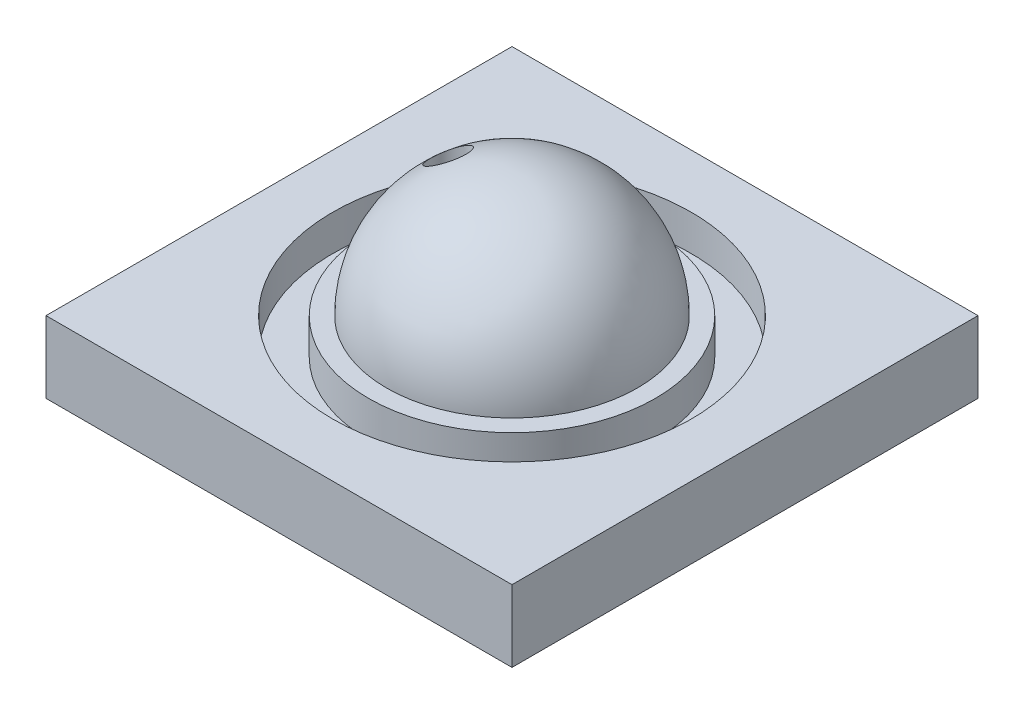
ISO-10303-21;
HEADER;
FILE_DESCRIPTION(('STEP AP214'),'2;1');
FILE_NAME('part.step','',(''),(''),'','','');
FILE_SCHEMA(('AUTOMOTIVE_DESIGN { 1 0 10303 214 1 1 1 1 }'));
ENDSEC;
DATA;
#1=APPLICATION_CONTEXT('core data for automotive mechanical design processes');
#2=APPLICATION_PROTOCOL_DEFINITION('international standard','automotive_design',2000,#1);
#3=PRODUCT_CONTEXT('',#1,'mechanical');
#4=PRODUCT('Part','Part','',(#3));
#5=PRODUCT_RELATED_PRODUCT_CATEGORY('part','',(#4));
#6=PRODUCT_DEFINITION_FORMATION('','',#4);
#7=PRODUCT_DEFINITION_CONTEXT('part definition',#1,'design');
#8=PRODUCT_DEFINITION('design','',#6,#7);
#9=PRODUCT_DEFINITION_SHAPE('','',#8);
#10=(LENGTH_UNIT() NAMED_UNIT(*) SI_UNIT(.MILLI.,.METRE.));
#11=(NAMED_UNIT(*) PLANE_ANGLE_UNIT() SI_UNIT($,.RADIAN.));
#12=(NAMED_UNIT(*) SI_UNIT($,.STERADIAN.) SOLID_ANGLE_UNIT());
#13=UNCERTAINTY_MEASURE_WITH_UNIT(LENGTH_MEASURE(1.E-05),#10,'distance_accuracy_value','');
#14=(GEOMETRIC_REPRESENTATION_CONTEXT(3) GLOBAL_UNCERTAINTY_ASSIGNED_CONTEXT((#13)) GLOBAL_UNIT_ASSIGNED_CONTEXT((#10,
#11,#12)) REPRESENTATION_CONTEXT('',''));
#15=CARTESIAN_POINT('',(0.,0.,0.));
#16=DIRECTION('',(0.,0.,1.));
#17=DIRECTION('',(1.,0.,0.));
#18=AXIS2_PLACEMENT_3D('',#15,#16,#17);
#19=CARTESIAN_POINT('',(0.,0.,0.));
#20=DIRECTION('',(0.,-1.,0.));
#21=DIRECTION('',(1.,0.,0.));
#22=AXIS2_PLACEMENT_3D('',#19,#20,#21);
#23=SPHERICAL_SURFACE('',#22,7.);
#24=CARTESIAN_POINT('',(0.,0.,0.));
#25=DIRECTION('',(0.,-1.,0.));
#26=DIRECTION('',(0.,0.,-1.));
#27=AXIS2_PLACEMENT_3D('',#24,#25,#26);
#28=CIRCLE('',#27,7.);
#29=CARTESIAN_POINT('',(0.,0.,-7.));
#30=VERTEX_POINT('',#29);
#31=EDGE_CURVE('E11',#30,#30,#28,.T.);
#32=ORIENTED_EDGE('',*,*,#31,.F.);
#33=EDGE_LOOP('',(#32));
#34=FACE_BOUND('',#33,.T.);
#35=CARTESIAN_POINT('',(-4.44527156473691,5.3861413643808,-0.478583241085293));
#36=CARTESIAN_POINT('',(-4.41714678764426,5.40476818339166,-0.530176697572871));
#37=CARTESIAN_POINT('',(-4.38483107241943,5.42607342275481,-0.578602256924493));
#38=CARTESIAN_POINT('',(-4.31351228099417,5.47275944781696,-0.668099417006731));
#39=CARTESIAN_POINT('',(-4.27448929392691,5.49815235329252,-0.709148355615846));
#40=CARTESIAN_POINT('',(-4.19160901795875,5.55166408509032,-0.783076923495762));
#41=CARTESIAN_POINT('',(-4.14778783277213,5.57976238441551,-0.816012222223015));
#42=CARTESIAN_POINT('',(-4.05639225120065,5.63789035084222,-0.873868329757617));
#43=CARTESIAN_POINT('',(-4.00881982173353,5.66791900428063,-0.898793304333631));
#44=CARTESIAN_POINT('',(-3.90435067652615,5.73331519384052,-0.943395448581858));
#45=CARTESIAN_POINT('',(-3.84706307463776,5.76885551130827,-0.96190690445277));
#46=CARTESIAN_POINT('',(-3.73043151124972,5.84053105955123,-0.988405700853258));
#47=CARTESIAN_POINT('',(-3.67108609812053,5.8766667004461,-0.996385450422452));
#48=CARTESIAN_POINT('',(-3.54645207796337,5.95186045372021,-1.00189516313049));
#49=CARTESIAN_POINT('',(-3.48110214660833,5.99089430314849,-0.998438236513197));
#50=CARTESIAN_POINT('',(-3.35150289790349,6.06757259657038,-0.97865162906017));
#51=CARTESIAN_POINT('',(-3.2872537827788,6.10521678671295,-0.962319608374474));
#52=CARTESIAN_POINT('',(-3.16285688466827,6.17747041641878,-0.916953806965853));
#53=CARTESIAN_POINT('',(-3.10266445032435,6.21211481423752,-0.888100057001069));
#54=CARTESIAN_POINT('',(-2.98782542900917,6.27771320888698,-0.817809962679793));
#55=CARTESIAN_POINT('',(-2.93317520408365,6.3086696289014,-0.776381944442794));
#56=CARTESIAN_POINT('',(-2.8375644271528,6.36249063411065,-0.686602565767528));
#57=CARTESIAN_POINT('',(-2.79576645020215,6.38586539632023,-0.639453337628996));
#58=CARTESIAN_POINT('',(-2.72102918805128,6.42747920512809,-0.536627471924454));
#59=CARTESIAN_POINT('',(-2.6880787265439,6.4457247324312,-0.480961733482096));
#60=CARTESIAN_POINT('',(-2.63707862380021,6.47388343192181,-0.371395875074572));
#61=CARTESIAN_POINT('',(-2.61757140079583,6.48461535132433,-0.318383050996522));
#62=CARTESIAN_POINT('',(-2.5877013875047,6.50102647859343,-0.209102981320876));
#63=CARTESIAN_POINT('',(-2.57733094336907,6.50670991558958,-0.152838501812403));
#64=CARTESIAN_POINT('',(-2.56695267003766,6.51239694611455,-0.045252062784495));
#65=CARTESIAN_POINT('',(-2.56594668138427,6.512947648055,0.0059474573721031));
#66=CARTESIAN_POINT('',(-2.57174701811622,6.50976996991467,0.107759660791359));
#67=CARTESIAN_POINT('',(-2.57855141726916,6.50604264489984,0.158372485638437));
#68=CARTESIAN_POINT('',(-2.59930698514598,6.49465223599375,0.256015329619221));
#69=CARTESIAN_POINT('',(-2.61303634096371,6.48711128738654,0.303107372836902));
#70=CARTESIAN_POINT('',(-2.64690577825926,6.46845977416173,0.39416400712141));
#71=CARTESIAN_POINT('',(-2.66704669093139,6.45734874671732,0.438128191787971));
#72=CARTESIAN_POINT('',(-2.71402759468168,6.43134385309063,0.523977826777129));
#73=CARTESIAN_POINT('',(-2.74113840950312,6.41629647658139,0.565667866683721));
#74=CARTESIAN_POINT('',(-2.80050748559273,6.38320404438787,0.643855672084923));
#75=CARTESIAN_POINT('',(-2.832767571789,6.36515792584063,0.680351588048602));
#76=CARTESIAN_POINT('',(-2.90494414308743,6.32458479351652,0.751123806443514));
#77=CARTESIAN_POINT('',(-2.94530639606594,6.30178814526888,0.784789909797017));
#78=CARTESIAN_POINT('',(-3.02978830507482,6.2537830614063,0.844895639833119));
#79=CARTESIAN_POINT('',(-3.07390972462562,6.2285734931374,0.871331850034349));
#80=CARTESIAN_POINT('',(-3.17060233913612,6.1729620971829,0.919767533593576));
#81=CARTESIAN_POINT('',(-3.22353166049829,6.14230894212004,0.940763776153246));
#82=CARTESIAN_POINT('',(-3.33128596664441,6.07940737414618,0.973398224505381));
#83=CARTESIAN_POINT('',(-3.38611183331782,6.04715821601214,0.985032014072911));
#84=CARTESIAN_POINT('',(-3.50284749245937,5.97792071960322,0.999853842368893));
#85=CARTESIAN_POINT('',(-3.56483689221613,5.9408187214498,1.00189700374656));
#86=CARTESIAN_POINT('',(-3.68803640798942,5.86637615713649,0.994594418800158));
#87=CARTESIAN_POINT('',(-3.74924595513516,5.82903544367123,0.985240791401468));
#88=CARTESIAN_POINT('',(-3.87296083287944,5.75284119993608,0.954376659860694));
#89=CARTESIAN_POINT('',(-3.935321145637,5.71403251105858,0.932166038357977));
#90=CARTESIAN_POINT('',(-4.05545064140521,5.63853716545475,0.87524315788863));
#91=CARTESIAN_POINT('',(-4.11322363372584,5.60184875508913,0.840541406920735));
#92=CARTESIAN_POINT('',(-4.21133773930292,5.53898004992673,0.766888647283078));
#93=CARTESIAN_POINT('',(-4.25287968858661,5.51214691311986,0.730091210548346));
#94=CARTESIAN_POINT('',(-4.33020511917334,5.46187571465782,0.648851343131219));
#95=CARTESIAN_POINT('',(-4.36599031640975,5.43843664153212,0.604411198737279));
#96=CARTESIAN_POINT('',(-4.4304861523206,5.39596711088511,0.508107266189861));
#97=CARTESIAN_POINT('',(-4.45913472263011,5.37697541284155,0.456184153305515));
#98=CARTESIAN_POINT('',(-4.50717287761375,5.34501125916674,0.346517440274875));
#99=CARTESIAN_POINT('',(-4.52657479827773,5.33203078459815,0.288781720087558));
#100=CARTESIAN_POINT('',(-4.55252541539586,5.31463872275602,0.178607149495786));
#101=CARTESIAN_POINT('',(-4.56056684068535,5.3092330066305,0.126675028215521));
#102=CARTESIAN_POINT('',(-4.56836485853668,5.30399121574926,0.0219105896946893));
#103=CARTESIAN_POINT('',(-4.56812516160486,5.30415264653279,-0.0309213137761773));
#104=CARTESIAN_POINT('',(-4.55984611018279,5.30971719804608,-0.130125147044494));
#105=CARTESIAN_POINT('',(-4.55261650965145,5.31457612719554,-0.176599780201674));
#106=CARTESIAN_POINT('',(-4.53192462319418,5.32844664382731,-0.267448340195));
#107=CARTESIAN_POINT('',(-4.51846915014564,5.337453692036,-0.311824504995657));
#108=CARTESIAN_POINT('',(-4.49408135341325,5.35371986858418,-0.376133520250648));
#109=CARTESIAN_POINT('',(-4.48522680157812,5.3596174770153,-0.397238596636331));
#110=CARTESIAN_POINT('',(-4.46621020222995,5.37225959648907,-0.438578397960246));
#111=CARTESIAN_POINT('',(-4.45604856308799,5.37900384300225,-0.458813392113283));
#112=CARTESIAN_POINT('',(-4.44527156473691,5.3861413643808,-0.478583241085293));
#113=B_SPLINE_CURVE_WITH_KNOTS('',3,(#35,#36,#37,#38,#39,#40,#41,#42,#43,#44,#45,#46,#47,#48,
#49,#50,#51,#52,#53,#54,#55,#56,#57,#58,#59,#60,#61,#62,#63,#64,#65,#66,#67,#68,#69,#70,#71,#72,
#73,#74,#75,#76,#77,#78,#79,#80,#81,#82,#83,#84,#85,#86,#87,#88,#89,#90,#91,#92,#93,#94,#95,#96,
#97,#98,#99,#100,#101,#102,#103,#104,#105,#106,#107,#108,#109,#110,#111,#112),.UNSPECIFIED.,.T.,
.F.,(4,2,2,2,2,2,2,2,2,2,2,2,2,2,2,2,2,2,2,2,2,2,2,2,2,2,2,2,2,2,2,2,2,2,2,2,2,2,4),(0.,
0.184830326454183,0.370219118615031,0.554298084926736,0.738281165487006,0.947148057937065,
1.1561654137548,1.38367347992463,1.61122290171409,1.83560383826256,2.05983652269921,
2.26026097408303,2.46043104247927,2.63195600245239,2.80333713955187,2.95621000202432,
3.10904517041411,3.25726927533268,3.40551260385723,3.5607375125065,3.71601755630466,
3.88720185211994,4.058466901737,4.25168745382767,4.44499909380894,4.66088438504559,
4.87691904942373,5.1060015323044,5.33489175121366,5.51907849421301,5.70321023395,
5.88889148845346,6.07432432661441,6.23190824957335,6.38942156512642,6.53063382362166,
6.67169191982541,6.74253824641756,6.81336249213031),.UNSPECIFIED.);
#114=CARTESIAN_POINT('',(-4.44527156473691,5.3861413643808,-0.478583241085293));
#115=VERTEX_POINT('',#114);
#116=EDGE_CURVE('E37',#115,#115,#113,.T.);
#117=ORIENTED_EDGE('',*,*,#116,.T.);
#118=EDGE_LOOP('',(#117));
#119=FACE_BOUND('',#118,.T.);
#120=ADVANCED_FACE('F33',(#34,#119),#23,.T.);
#121=CARTESIAN_POINT('',(13.,-4.,13.));
#122=DIRECTION('',(1.,0.,0.));
#123=DIRECTION('',(0.,0.,-1.));
#124=AXIS2_PLACEMENT_3D('',#121,#122,#123);
#125=PLANE('',#124);
#126=DIRECTION('',(0.,0.,-1.));
#127=VECTOR('',#126,1.);
#128=CARTESIAN_POINT('',(13.,0.,13.));
#129=LINE('',#128,#127);
#130=CARTESIAN_POINT('',(13.,0.,13.));
#131=VERTEX_POINT('',#130);
#132=CARTESIAN_POINT('',(13.,0.,-13.));
#133=VERTEX_POINT('',#132);
#134=EDGE_CURVE('E105',#131,#133,#129,.T.);
#135=ORIENTED_EDGE('',*,*,#134,.F.);
#136=DIRECTION('',(0.,1.,0.));
#137=VECTOR('',#136,1.);
#138=CARTESIAN_POINT('',(13.,-4.,13.));
#139=LINE('',#138,#137);
#140=CARTESIAN_POINT('',(13.,-4.,13.));
#141=VERTEX_POINT('',#140);
#142=EDGE_CURVE('E46',#141,#131,#139,.T.);
#143=ORIENTED_EDGE('',*,*,#142,.F.);
#144=DIRECTION('',(0.,0.,-1.));
#145=VECTOR('',#144,1.);
#146=CARTESIAN_POINT('',(13.,-4.,13.));
#147=LINE('',#146,#145);
#148=CARTESIAN_POINT('',(13.,-4.,-13.));
#149=VERTEX_POINT('',#148);
#150=EDGE_CURVE('E98',#141,#149,#147,.T.);
#151=ORIENTED_EDGE('',*,*,#150,.T.);
#152=DIRECTION('',(0.,1.,0.));
#153=VECTOR('',#152,1.);
#154=CARTESIAN_POINT('',(13.,-4.,-13.));
#155=LINE('',#154,#153);
#156=EDGE_CURVE('E81',#149,#133,#155,.T.);
#157=ORIENTED_EDGE('',*,*,#156,.T.);
#158=EDGE_LOOP('',(#135,#143,#151,#157));
#159=FACE_BOUND('',#158,.T.);
#160=ADVANCED_FACE('F116',(#159),#125,.T.);
#161=CARTESIAN_POINT('',(-13.,-4.,13.));
#162=DIRECTION('',(0.,0.,1.));
#163=DIRECTION('',(1.,0.,0.));
#164=AXIS2_PLACEMENT_3D('',#161,#162,#163);
#165=PLANE('',#164);
#166=DIRECTION('',(1.,0.,0.));
#167=VECTOR('',#166,1.);
#168=CARTESIAN_POINT('',(-13.,0.,13.));
#169=LINE('',#168,#167);
#170=CARTESIAN_POINT('',(-13.,0.,13.));
#171=VERTEX_POINT('',#170);
#172=EDGE_CURVE('E100',#171,#131,#169,.T.);
#173=ORIENTED_EDGE('',*,*,#172,.F.);
#174=DIRECTION('',(0.,1.,0.));
#175=VECTOR('',#174,1.);
#176=CARTESIAN_POINT('',(-13.,-4.,13.));
#177=LINE('',#176,#175);
#178=CARTESIAN_POINT('',(-13.,-4.,13.));
#179=VERTEX_POINT('',#178);
#180=EDGE_CURVE('E70',#179,#171,#177,.T.);
#181=ORIENTED_EDGE('',*,*,#180,.F.);
#182=DIRECTION('',(1.,0.,0.));
#183=VECTOR('',#182,1.);
#184=CARTESIAN_POINT('',(-13.,-4.,13.));
#185=LINE('',#184,#183);
#186=EDGE_CURVE('E95',#179,#141,#185,.T.);
#187=ORIENTED_EDGE('',*,*,#186,.T.);
#188=ORIENTED_EDGE('',*,*,#142,.T.);
#189=EDGE_LOOP('',(#173,#181,#187,#188));
#190=FACE_BOUND('',#189,.T.);
#191=ADVANCED_FACE('F119',(#190),#165,.T.);
#192=CARTESIAN_POINT('',(-13.,-4.,13.));
#193=DIRECTION('',(-1.,0.,0.));
#194=DIRECTION('',(0.,0.,1.));
#195=AXIS2_PLACEMENT_3D('',#192,#193,#194);
#196=PLANE('',#195);
#197=DIRECTION('',(0.,0.,1.));
#198=VECTOR('',#197,1.);
#199=CARTESIAN_POINT('',(-13.,0.,13.));
#200=LINE('',#199,#198);
#201=CARTESIAN_POINT('',(-13.,0.,-13.));
#202=VERTEX_POINT('',#201);
#203=EDGE_CURVE('E89',#202,#171,#200,.T.);
#204=ORIENTED_EDGE('',*,*,#203,.F.);
#205=DIRECTION('',(0.,1.,0.));
#206=VECTOR('',#205,1.);
#207=CARTESIAN_POINT('',(-13.,-4.,-13.));
#208=LINE('',#207,#206);
#209=CARTESIAN_POINT('',(-13.,-4.,-13.));
#210=VERTEX_POINT('',#209);
#211=EDGE_CURVE('E84',#210,#202,#208,.T.);
#212=ORIENTED_EDGE('',*,*,#211,.F.);
#213=DIRECTION('',(0.,0.,1.));
#214=VECTOR('',#213,1.);
#215=CARTESIAN_POINT('',(-13.,-4.,13.));
#216=LINE('',#215,#214);
#217=EDGE_CURVE('E87',#210,#179,#216,.T.);
#218=ORIENTED_EDGE('',*,*,#217,.T.);
#219=ORIENTED_EDGE('',*,*,#180,.T.);
#220=EDGE_LOOP('',(#204,#212,#218,#219));
#221=FACE_BOUND('',#220,.T.);
#222=ADVANCED_FACE('F86',(#221),#196,.T.);
#223=CARTESIAN_POINT('',(-13.,-4.,-13.));
#224=DIRECTION('',(0.,0.,-1.));
#225=DIRECTION('',(-1.,0.,0.));
#226=AXIS2_PLACEMENT_3D('',#223,#224,#225);
#227=PLANE('',#226);
#228=DIRECTION('',(-1.,0.,0.));
#229=VECTOR('',#228,1.);
#230=CARTESIAN_POINT('',(-13.,0.,-13.));
#231=LINE('',#230,#229);
#232=EDGE_CURVE('E108',#133,#202,#231,.T.);
#233=ORIENTED_EDGE('',*,*,#232,.F.);
#234=ORIENTED_EDGE('',*,*,#156,.F.);
#235=DIRECTION('',(-1.,0.,0.));
#236=VECTOR('',#235,1.);
#237=CARTESIAN_POINT('',(-13.,-4.,-13.));
#238=LINE('',#237,#236);
#239=EDGE_CURVE('E94',#149,#210,#238,.T.);
#240=ORIENTED_EDGE('',*,*,#239,.T.);
#241=ORIENTED_EDGE('',*,*,#211,.T.);
#242=EDGE_LOOP('',(#233,#234,#240,#241));
#243=FACE_BOUND('',#242,.T.);
#244=ADVANCED_FACE('F97',(#243),#227,.T.);
#245=CARTESIAN_POINT('',(0.,-4.,0.));
#246=DIRECTION('',(0.,-1.,0.));
#247=DIRECTION('',(0.,0.,-1.));
#248=AXIS2_PLACEMENT_3D('',#245,#246,#247);
#249=PLANE('',#248);
#250=ORIENTED_EDGE('',*,*,#150,.F.);
#251=ORIENTED_EDGE('',*,*,#186,.F.);
#252=ORIENTED_EDGE('',*,*,#217,.F.);
#253=ORIENTED_EDGE('',*,*,#239,.F.);
#254=EDGE_LOOP('',(#250,#251,#252,#253));
#255=FACE_BOUND('',#254,.T.);
#256=ADVANCED_FACE('F93',(#255),#249,.T.);
#257=CARTESIAN_POINT('',(0.,0.,0.));
#258=DIRECTION('',(0.,-1.,0.));
#259=DIRECTION('',(0.,0.,-1.));
#260=AXIS2_PLACEMENT_3D('',#257,#258,#259);
#261=PLANE('',#260);
#262=CARTESIAN_POINT('',(0.,0.,0.));
#263=DIRECTION('',(0.,1.,0.));
#264=DIRECTION('',(0.,0.,1.));
#265=AXIS2_PLACEMENT_3D('',#262,#263,#264);
#266=CIRCLE('',#265,10.);
#267=CARTESIAN_POINT('',(0.,0.,10.));
#268=VERTEX_POINT('',#267);
#269=EDGE_CURVE('E148',#268,#268,#266,.T.);
#270=ORIENTED_EDGE('',*,*,#269,.F.);
#271=EDGE_LOOP('',(#270));
#272=FACE_BOUND('',#271,.T.);
#273=ORIENTED_EDGE('',*,*,#134,.T.);
#274=ORIENTED_EDGE('',*,*,#232,.T.);
#275=ORIENTED_EDGE('',*,*,#203,.T.);
#276=ORIENTED_EDGE('',*,*,#172,.T.);
#277=EDGE_LOOP('',(#273,#274,#275,#276));
#278=FACE_BOUND('',#277,.T.);
#279=ADVANCED_FACE('F118',(#272,#278),#261,.F.);
#280=CARTESIAN_POINT('',(0.,-2.,0.));
#281=DIRECTION('',(0.,1.,0.));
#282=DIRECTION('',(0.,0.,1.));
#283=AXIS2_PLACEMENT_3D('',#280,#281,#282);
#284=CYLINDRICAL_SURFACE('',#283,10.);
#285=CARTESIAN_POINT('',(0.,-2.,0.));
#286=DIRECTION('',(0.,1.,0.));
#287=DIRECTION('',(0.,0.,1.));
#288=AXIS2_PLACEMENT_3D('',#285,#286,#287);
#289=CIRCLE('',#288,10.);
#290=CARTESIAN_POINT('',(0.,-2.,10.));
#291=VERTEX_POINT('',#290);
#292=EDGE_CURVE('E109',#291,#291,#289,.T.);
#293=ORIENTED_EDGE('',*,*,#292,.F.);
#294=EDGE_LOOP('',(#293));
#295=FACE_BOUND('',#294,.T.);
#296=ORIENTED_EDGE('',*,*,#269,.T.);
#297=EDGE_LOOP('',(#296));
#298=FACE_BOUND('',#297,.T.);
#299=ADVANCED_FACE('F154',(#295,#298),#284,.F.);
#300=CARTESIAN_POINT('',(0.,-2.,0.));
#301=DIRECTION('',(0.,1.,0.));
#302=DIRECTION('',(0.,0.,1.));
#303=AXIS2_PLACEMENT_3D('',#300,#301,#302);
#304=PLANE('',#303);
#305=CARTESIAN_POINT('',(0.,-2.,0.));
#306=DIRECTION('',(0.,1.,0.));
#307=DIRECTION('',(0.,0.,1.));
#308=AXIS2_PLACEMENT_3D('',#305,#306,#307);
#309=CIRCLE('',#308,8.);
#310=CARTESIAN_POINT('',(0.,-2.,8.));
#311=VERTEX_POINT('',#310);
#312=EDGE_CURVE('E140',#311,#311,#309,.T.);
#313=ORIENTED_EDGE('',*,*,#312,.F.);
#314=EDGE_LOOP('',(#313));
#315=FACE_BOUND('',#314,.T.);
#316=ORIENTED_EDGE('',*,*,#292,.T.);
#317=EDGE_LOOP('',(#316));
#318=FACE_BOUND('',#317,.T.);
#319=ADVANCED_FACE('F162',(#315,#318),#304,.T.);
#320=CARTESIAN_POINT('',(0.,-2.,0.));
#321=DIRECTION('',(0.,1.,0.));
#322=DIRECTION('',(0.,0.,1.));
#323=AXIS2_PLACEMENT_3D('',#320,#321,#322);
#324=CYLINDRICAL_SURFACE('',#323,8.);
#325=ORIENTED_EDGE('',*,*,#312,.T.);
#326=EDGE_LOOP('',(#325));
#327=FACE_BOUND('',#326,.T.);
#328=CARTESIAN_POINT('',(0.,0.,0.));
#329=DIRECTION('',(0.,1.,0.));
#330=DIRECTION('',(0.,0.,1.));
#331=AXIS2_PLACEMENT_3D('',#328,#329,#330);
#332=CIRCLE('',#331,8.);
#333=CARTESIAN_POINT('',(0.,0.,8.));
#334=VERTEX_POINT('',#333);
#335=EDGE_CURVE('E137',#334,#334,#332,.T.);
#336=ORIENTED_EDGE('',*,*,#335,.F.);
#337=EDGE_LOOP('',(#336));
#338=FACE_BOUND('',#337,.T.);
#339=ADVANCED_FACE('F168',(#327,#338),#324,.T.);
#340=ORIENTED_EDGE('',*,*,#31,.T.);
#341=EDGE_LOOP('',(#340));
#342=FACE_BOUND('',#341,.T.);
#343=ORIENTED_EDGE('',*,*,#335,.T.);
#344=EDGE_LOOP('',(#343));
#345=FACE_BOUND('',#344,.T.);
#346=ADVANCED_FACE('F157',(#342,#345),#261,.F.);
#347=CARTESIAN_POINT('',(-3.56722937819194,12.,0.));
#348=DIRECTION('',(0.,-1.,0.));
#349=DIRECTION('',(0.,0.,-1.));
#350=AXIS2_PLACEMENT_3D('',#347,#348,#349);
#351=CYLINDRICAL_SURFACE('',#350,1.);
#352=ORIENTED_EDGE('',*,*,#116,.F.);
#353=EDGE_LOOP('',(#352));
#354=FACE_BOUND('',#353,.T.);
#355=CARTESIAN_POINT('',(-3.56722937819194,0.,0.));
#356=DIRECTION('',(0.,1.,0.));
#357=DIRECTION('',(0.,0.,1.));
#358=AXIS2_PLACEMENT_3D('',#355,#356,#357);
#359=CIRCLE('',#358,1.);
#360=CARTESIAN_POINT('',(-3.56722937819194,0.,1.));
#361=VERTEX_POINT('',#360);
#362=EDGE_CURVE('E138',#361,#361,#359,.T.);
#363=ORIENTED_EDGE('',*,*,#362,.F.);
#364=EDGE_LOOP('',(#363));
#365=FACE_BOUND('',#364,.T.);
#366=ADVANCED_FACE('F167',(#354,#365),#351,.F.);
#367=CARTESIAN_POINT('',(-3.56722937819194,0.,0.));
#368=DIRECTION('',(0.,1.,0.));
#369=DIRECTION('',(0.,0.,1.));
#370=AXIS2_PLACEMENT_3D('',#367,#368,#369);
#371=PLANE('',#370);
#372=ORIENTED_EDGE('',*,*,#362,.T.);
#373=EDGE_LOOP('',(#372));
#374=FACE_BOUND('',#373,.T.);
#375=ADVANCED_FACE('F174',(#374),#371,.T.);
#376=CLOSED_SHELL('',(#120,#160,#191,#222,#244,#256,#279,#299,#319,#339,#346,#366,#375));
#377=MANIFOLD_SOLID_BREP('B2',#376);
#378=ADVANCED_BREP_SHAPE_REPRESENTATION('',(#18,#377),#14);
#379=SHAPE_DEFINITION_REPRESENTATION(#9,#378);
ENDSEC;
END-ISO-10303-21;
